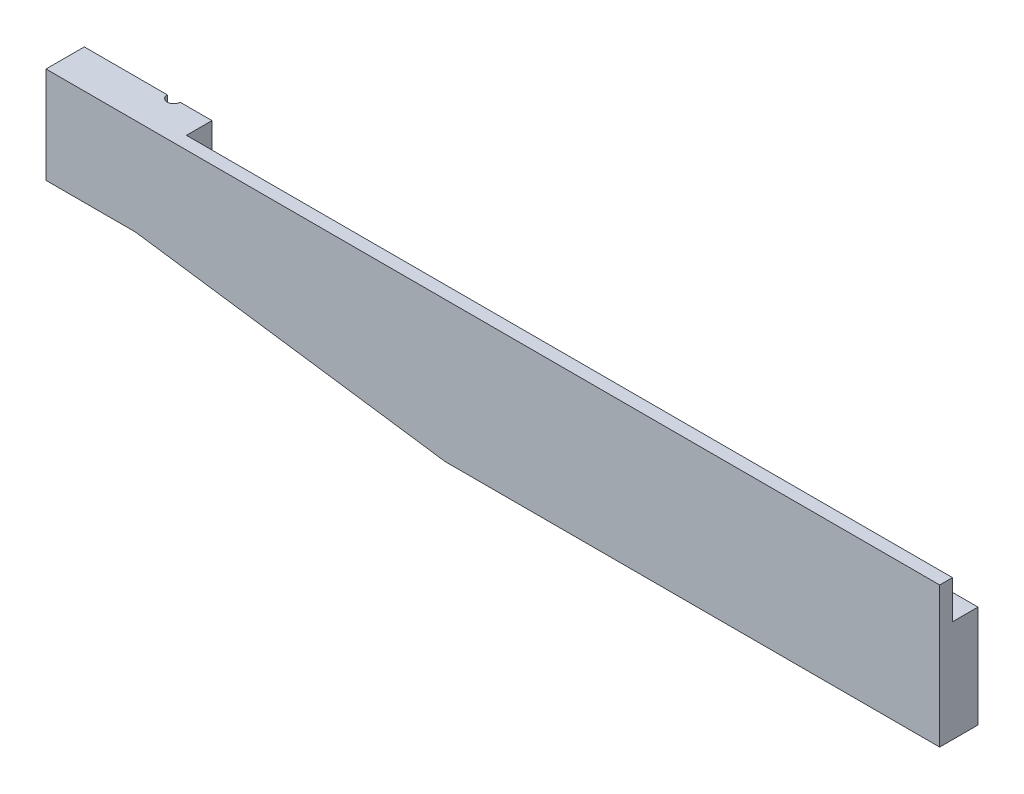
ISO-10303-21;
HEADER;
FILE_DESCRIPTION(('STEP AP214'),'2;1');
FILE_NAME('part.step','',(''),(''),'','','');
FILE_SCHEMA(('AUTOMOTIVE_DESIGN { 1 0 10303 214 1 1 1 1 }'));
ENDSEC;
DATA;
#1=APPLICATION_CONTEXT('core data for automotive mechanical design processes');
#2=APPLICATION_PROTOCOL_DEFINITION('international standard','automotive_design',2000,#1);
#3=PRODUCT_CONTEXT('',#1,'mechanical');
#4=PRODUCT('Part','Part','',(#3));
#5=PRODUCT_RELATED_PRODUCT_CATEGORY('part','',(#4));
#6=PRODUCT_DEFINITION_FORMATION('','',#4);
#7=PRODUCT_DEFINITION_CONTEXT('part definition',#1,'design');
#8=PRODUCT_DEFINITION('design','',#6,#7);
#9=PRODUCT_DEFINITION_SHAPE('','',#8);
#10=(LENGTH_UNIT() NAMED_UNIT(*) SI_UNIT(.MILLI.,.METRE.));
#11=(NAMED_UNIT(*) PLANE_ANGLE_UNIT() SI_UNIT($,.RADIAN.));
#12=(NAMED_UNIT(*) SI_UNIT($,.STERADIAN.) SOLID_ANGLE_UNIT());
#13=UNCERTAINTY_MEASURE_WITH_UNIT(LENGTH_MEASURE(1.E-05),#10,'distance_accuracy_value','');
#14=(GEOMETRIC_REPRESENTATION_CONTEXT(3) GLOBAL_UNCERTAINTY_ASSIGNED_CONTEXT((#13)) GLOBAL_UNIT_ASSIGNED_CONTEXT((#10,
#11,#12)) REPRESENTATION_CONTEXT('',''));
#15=CARTESIAN_POINT('',(0.,0.,0.));
#16=DIRECTION('',(0.,0.,1.));
#17=DIRECTION('',(1.,0.,0.));
#18=AXIS2_PLACEMENT_3D('',#15,#16,#17);
#19=CARTESIAN_POINT('',(-629.274019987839,69.85,-19.05));
#20=DIRECTION('',(0.,0.,1.));
#21=DIRECTION('',(1.,0.,0.));
#22=AXIS2_PLACEMENT_3D('',#19,#20,#21);
#23=PLANE('',#22);
#24=DIRECTION('',(-0.990076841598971,0.14052703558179,0.));
#25=VECTOR('',#24,1.);
#26=CARTESIAN_POINT('',(-631.424826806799,54.696588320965,-19.05));
#27=LINE('',#26,#25);
#28=CARTESIAN_POINT('',(-246.0625,0.,-19.05));
#29=VERTEX_POINT('',#28);
#30=CARTESIAN_POINT('',(-396.875,21.4056451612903,-19.05));
#31=VERTEX_POINT('',#30);
#32=EDGE_CURVE('E133',#29,#31,#27,.T.);
#33=ORIENTED_EDGE('',*,*,#32,.T.);
#34=DIRECTION('',(0.,1.,0.));
#35=VECTOR('',#34,1.);
#36=CARTESIAN_POINT('',(-396.875,-0.00100000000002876,-19.05));
#37=LINE('',#36,#35);
#38=CARTESIAN_POINT('',(-396.875,69.85,-19.05));
#39=VERTEX_POINT('',#38);
#40=EDGE_CURVE('E120',#39,#31,#37,.F.);
#41=ORIENTED_EDGE('',*,*,#40,.F.);
#42=DIRECTION('',(-1.,0.,0.));
#43=VECTOR('',#42,1.);
#44=CARTESIAN_POINT('',(-629.274019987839,69.85,-19.05));
#45=LINE('',#44,#43);
#46=CARTESIAN_POINT('',(-381.,69.85,-19.05));
#47=VERTEX_POINT('',#46);
#48=EDGE_CURVE('E131',#47,#39,#45,.T.);
#49=ORIENTED_EDGE('',*,*,#48,.F.);
#50=DIRECTION('',(0.,1.,0.));
#51=VECTOR('',#50,1.);
#52=CARTESIAN_POINT('',(-381.,50.8,-19.05));
#53=LINE('',#52,#51);
#54=CARTESIAN_POINT('',(-381.,50.8,-19.05));
#55=VERTEX_POINT('',#54);
#56=EDGE_CURVE('E58',#55,#47,#53,.T.);
#57=ORIENTED_EDGE('',*,*,#56,.F.);
#58=DIRECTION('',(1.,0.,0.));
#59=VECTOR('',#58,1.);
#60=CARTESIAN_POINT('',(-381.,50.8,-19.05));
#61=LINE('',#60,#59);
#62=CARTESIAN_POINT('',(0.,50.8,-19.05));
#63=VERTEX_POINT('',#62);
#64=EDGE_CURVE('E168',#55,#63,#61,.T.);
#65=ORIENTED_EDGE('',*,*,#64,.T.);
#66=DIRECTION('',(0.,-1.,0.));
#67=VECTOR('',#66,1.);
#68=CARTESIAN_POINT('',(0.,69.85,-19.05));
#69=LINE('',#68,#67);
#70=CARTESIAN_POINT('',(0.,0.,-19.05));
#71=VERTEX_POINT('',#70);
#72=EDGE_CURVE('E138',#63,#71,#69,.T.);
#73=ORIENTED_EDGE('',*,*,#72,.T.);
#74=DIRECTION('',(-1.,0.,0.));
#75=VECTOR('',#74,1.);
#76=CARTESIAN_POINT('',(-629.274019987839,0.,-19.05));
#77=LINE('',#76,#75);
#78=EDGE_CURVE('E154',#71,#29,#77,.T.);
#79=ORIENTED_EDGE('',*,*,#78,.T.);
#80=EDGE_LOOP('',(#33,#41,#49,#57,#65,#73,#79));
#81=FACE_BOUND('',#80,.T.);
#82=ADVANCED_FACE('F35',(#81),#23,.F.);
#83=CARTESIAN_POINT('',(-629.274019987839,69.85,0.));
#84=DIRECTION('',(0.,0.,1.));
#85=DIRECTION('',(1.,0.,0.));
#86=AXIS2_PLACEMENT_3D('',#83,#84,#85);
#87=PLANE('',#86);
#88=DIRECTION('',(-1.,0.,0.));
#89=VECTOR('',#88,1.);
#90=CARTESIAN_POINT('',(-629.274019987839,69.85,0.));
#91=LINE('',#90,#89);
#92=CARTESIAN_POINT('',(0.,69.85,0.));
#93=VERTEX_POINT('',#92);
#94=CARTESIAN_POINT('',(-444.5,69.85,0.));
#95=VERTEX_POINT('',#94);
#96=EDGE_CURVE('E155',#93,#95,#91,.T.);
#97=ORIENTED_EDGE('',*,*,#96,.T.);
#98=DIRECTION('',(0.,1.,0.));
#99=VECTOR('',#98,1.);
#100=CARTESIAN_POINT('',(-444.5,21.8562903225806,0.));
#101=LINE('',#100,#99);
#102=CARTESIAN_POINT('',(-444.5,21.8562903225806,0.));
#103=VERTEX_POINT('',#102);
#104=EDGE_CURVE('E216',#103,#95,#101,.T.);
#105=ORIENTED_EDGE('',*,*,#104,.F.);
#106=DIRECTION('',(1.,0.,0.));
#107=VECTOR('',#106,1.);
#108=CARTESIAN_POINT('',(-444.5,21.8562903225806,0.));
#109=LINE('',#108,#107);
#110=CARTESIAN_POINT('',(-400.05,21.8562903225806,0.));
#111=VERTEX_POINT('',#110);
#112=EDGE_CURVE('E177',#103,#111,#109,.T.);
#113=ORIENTED_EDGE('',*,*,#112,.T.);
#114=DIRECTION('',(-0.990076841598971,0.14052703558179,0.));
#115=VECTOR('',#114,1.);
#116=CARTESIAN_POINT('',(-631.424826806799,54.696588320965,0.));
#117=LINE('',#116,#115);
#118=CARTESIAN_POINT('',(-246.0625,0.,0.));
#119=VERTEX_POINT('',#118);
#120=EDGE_CURVE('E151',#119,#111,#117,.T.);
#121=ORIENTED_EDGE('',*,*,#120,.F.);
#122=DIRECTION('',(-1.,0.,0.));
#123=VECTOR('',#122,1.);
#124=CARTESIAN_POINT('',(-629.274019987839,0.,0.));
#125=LINE('',#124,#123);
#126=CARTESIAN_POINT('',(0.,0.,0.));
#127=VERTEX_POINT('',#126);
#128=EDGE_CURVE('E147',#127,#119,#125,.T.);
#129=ORIENTED_EDGE('',*,*,#128,.F.);
#130=DIRECTION('',(0.,-1.,0.));
#131=VECTOR('',#130,1.);
#132=CARTESIAN_POINT('',(0.,69.85,0.));
#133=LINE('',#132,#131);
#134=EDGE_CURVE('E141',#93,#127,#133,.T.);
#135=ORIENTED_EDGE('',*,*,#134,.F.);
#136=EDGE_LOOP('',(#97,#105,#113,#121,#129,#135));
#137=FACE_BOUND('',#136,.T.);
#138=ADVANCED_FACE('F37',(#137),#87,.T.);
#139=CARTESIAN_POINT('',(-403.225,69.85,-19.05));
#140=VERTEX_POINT('',#139);
#141=CARTESIAN_POINT('',(-444.5,69.85,-19.05));
#142=VERTEX_POINT('',#141);
#143=EDGE_CURVE('E139',#140,#142,#45,.T.);
#144=ORIENTED_EDGE('',*,*,#143,.F.);
#145=DIRECTION('',(0.,1.,0.));
#146=VECTOR('',#145,1.);
#147=CARTESIAN_POINT('',(-403.225,-0.00100000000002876,-19.05));
#148=LINE('',#147,#146);
#149=CARTESIAN_POINT('',(-403.225,21.8562903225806,-19.05));
#150=VERTEX_POINT('',#149);
#151=EDGE_CURVE('E122',#150,#140,#148,.T.);
#152=ORIENTED_EDGE('',*,*,#151,.F.);
#153=DIRECTION('',(1.,0.,0.));
#154=VECTOR('',#153,1.);
#155=CARTESIAN_POINT('',(-444.5,21.8562903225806,-19.05));
#156=LINE('',#155,#154);
#157=CARTESIAN_POINT('',(-444.5,21.8562903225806,-19.05));
#158=VERTEX_POINT('',#157);
#159=EDGE_CURVE('E191',#158,#150,#156,.T.);
#160=ORIENTED_EDGE('',*,*,#159,.F.);
#161=DIRECTION('',(0.,-1.,0.));
#162=VECTOR('',#161,1.);
#163=CARTESIAN_POINT('',(-444.5,21.8562903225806,-19.05));
#164=LINE('',#163,#162);
#165=EDGE_CURVE('E211',#142,#158,#164,.T.);
#166=ORIENTED_EDGE('',*,*,#165,.F.);
#167=EDGE_LOOP('',(#144,#152,#160,#166));
#168=FACE_BOUND('',#167,.T.);
#169=ADVANCED_FACE('F224',(#168),#23,.F.);
#170=CARTESIAN_POINT('',(-629.274019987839,69.85,-9.52499999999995));
#171=DIRECTION('',(0.,1.,0.));
#172=DIRECTION('',(0.,0.,1.));
#173=AXIS2_PLACEMENT_3D('',#170,#171,#172);
#174=PLANE('',#173);
#175=CARTESIAN_POINT('',(-400.05,69.85,-19.05));
#176=DIRECTION('',(0.,1.,0.));
#177=DIRECTION('',(0.,0.,1.));
#178=AXIS2_PLACEMENT_3D('',#175,#176,#177);
#179=CIRCLE('',#178,3.17499999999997);
#180=EDGE_CURVE('E117',#140,#39,#179,.T.);
#181=ORIENTED_EDGE('',*,*,#180,.F.);
#182=ORIENTED_EDGE('',*,*,#143,.T.);
#183=DIRECTION('',(0.,0.,-1.));
#184=VECTOR('',#183,1.);
#185=CARTESIAN_POINT('',(-444.5,69.85,0.));
#186=LINE('',#185,#184);
#187=EDGE_CURVE('E213',#95,#142,#186,.T.);
#188=ORIENTED_EDGE('',*,*,#187,.F.);
#189=ORIENTED_EDGE('',*,*,#96,.F.);
#190=DIRECTION('',(0.,0.,-1.));
#191=VECTOR('',#190,1.);
#192=CARTESIAN_POINT('',(0.,69.85,-9.52499999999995));
#193=LINE('',#192,#191);
#194=CARTESIAN_POINT('',(0.,69.85,-6.35));
#195=VERTEX_POINT('',#194);
#196=EDGE_CURVE('E143',#93,#195,#193,.T.);
#197=ORIENTED_EDGE('',*,*,#196,.T.);
#198=DIRECTION('',(1.,0.,0.));
#199=VECTOR('',#198,1.);
#200=CARTESIAN_POINT('',(-381.,69.85,-6.35));
#201=LINE('',#200,#199);
#202=CARTESIAN_POINT('',(-381.,69.85,-6.35));
#203=VERTEX_POINT('',#202);
#204=EDGE_CURVE('E185',#203,#195,#201,.T.);
#205=ORIENTED_EDGE('',*,*,#204,.F.);
#206=DIRECTION('',(0.,0.,1.));
#207=VECTOR('',#206,1.);
#208=CARTESIAN_POINT('',(-381.,69.85,-19.05));
#209=LINE('',#208,#207);
#210=EDGE_CURVE('E137',#47,#203,#209,.T.);
#211=ORIENTED_EDGE('',*,*,#210,.F.);
#212=ORIENTED_EDGE('',*,*,#48,.T.);
#213=EDGE_LOOP('',(#181,#182,#188,#189,#197,#205,#211,#212));
#214=FACE_BOUND('',#213,.T.);
#215=ADVANCED_FACE('F135',(#214),#174,.T.);
#216=CARTESIAN_POINT('',(-492.125,34.925,621.777870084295));
#217=DIRECTION('',(0.14052703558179,0.990076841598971,0.));
#218=DIRECTION('',(-0.990076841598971,0.14052703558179,0.));
#219=AXIS2_PLACEMENT_3D('',#216,#217,#218);
#220=PLANE('',#219);
#221=DIRECTION('',(0.,0.,1.));
#222=VECTOR('',#221,1.);
#223=CARTESIAN_POINT('',(-400.05,21.8562903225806,621.777870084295));
#224=LINE('',#223,#222);
#225=CARTESIAN_POINT('',(-400.05,21.8562903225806,-15.875));
#226=VERTEX_POINT('',#225);
#227=EDGE_CURVE('E11',#226,#111,#224,.T.);
#228=ORIENTED_EDGE('',*,*,#227,.F.);
#229=CARTESIAN_POINT('',(-400.05,21.8562903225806,-19.05));
#230=DIRECTION('',(0.14052703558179,0.990076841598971,0.));
#231=DIRECTION('',(-0.990076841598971,0.14052703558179,0.));
#232=AXIS2_PLACEMENT_3D('',#229,#230,#231);
#233=ELLIPSE('',#232,3.20682180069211,3.17499999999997);
#234=EDGE_CURVE('E50',#31,#226,#233,.F.);
#235=ORIENTED_EDGE('',*,*,#234,.F.);
#236=ORIENTED_EDGE('',*,*,#32,.F.);
#237=DIRECTION('',(0.,0.,-1.));
#238=VECTOR('',#237,1.);
#239=CARTESIAN_POINT('',(-246.0625,0.,-9.52499999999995));
#240=LINE('',#239,#238);
#241=EDGE_CURVE('E43',#119,#29,#240,.T.);
#242=ORIENTED_EDGE('',*,*,#241,.F.);
#243=ORIENTED_EDGE('',*,*,#120,.T.);
#244=EDGE_LOOP('',(#228,#235,#236,#242,#243));
#245=FACE_BOUND('',#244,.T.);
#246=ADVANCED_FACE('F249',(#245),#220,.F.);
#247=CARTESIAN_POINT('',(0.,69.85,-9.52499999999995));
#248=DIRECTION('',(-1.,0.,0.));
#249=DIRECTION('',(0.,0.,1.));
#250=AXIS2_PLACEMENT_3D('',#247,#248,#249);
#251=PLANE('',#250);
#252=ORIENTED_EDGE('',*,*,#72,.F.);
#253=DIRECTION('',(0.,0.,-1.));
#254=VECTOR('',#253,1.);
#255=CARTESIAN_POINT('',(0.,50.8,-19.05));
#256=LINE('',#255,#254);
#257=CARTESIAN_POINT('',(0.,50.8,-6.35));
#258=VERTEX_POINT('',#257);
#259=EDGE_CURVE('E189',#258,#63,#256,.T.);
#260=ORIENTED_EDGE('',*,*,#259,.F.);
#261=DIRECTION('',(0.,-1.,0.));
#262=VECTOR('',#261,1.);
#263=CARTESIAN_POINT('',(0.,69.85,-6.35));
#264=LINE('',#263,#262);
#265=EDGE_CURVE('E188',#195,#258,#264,.T.);
#266=ORIENTED_EDGE('',*,*,#265,.F.);
#267=ORIENTED_EDGE('',*,*,#196,.F.);
#268=ORIENTED_EDGE('',*,*,#134,.T.);
#269=DIRECTION('',(0.,0.,-1.));
#270=VECTOR('',#269,1.);
#271=CARTESIAN_POINT('',(0.,0.,-9.52499999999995));
#272=LINE('',#271,#270);
#273=EDGE_CURVE('E150',#127,#71,#272,.T.);
#274=ORIENTED_EDGE('',*,*,#273,.T.);
#275=EDGE_LOOP('',(#252,#260,#266,#267,#268,#274));
#276=FACE_BOUND('',#275,.T.);
#277=ADVANCED_FACE('F171',(#276),#251,.F.);
#278=CARTESIAN_POINT('',(-629.274019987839,0.,-9.52499999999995));
#279=DIRECTION('',(0.,1.,0.));
#280=DIRECTION('',(0.,0.,1.));
#281=AXIS2_PLACEMENT_3D('',#278,#279,#280);
#282=PLANE('',#281);
#283=ORIENTED_EDGE('',*,*,#128,.T.);
#284=ORIENTED_EDGE('',*,*,#241,.T.);
#285=ORIENTED_EDGE('',*,*,#78,.F.);
#286=ORIENTED_EDGE('',*,*,#273,.F.);
#287=EDGE_LOOP('',(#283,#284,#285,#286));
#288=FACE_BOUND('',#287,.T.);
#289=ADVANCED_FACE('F160',(#288),#282,.F.);
#290=CARTESIAN_POINT('',(-381.,50.8,-19.05));
#291=DIRECTION('',(0.,-1.,0.));
#292=DIRECTION('',(0.,0.,-1.));
#293=AXIS2_PLACEMENT_3D('',#290,#291,#292);
#294=PLANE('',#293);
#295=ORIENTED_EDGE('',*,*,#259,.T.);
#296=ORIENTED_EDGE('',*,*,#64,.F.);
#297=DIRECTION('',(0.,0.,-1.));
#298=VECTOR('',#297,1.);
#299=CARTESIAN_POINT('',(-381.,50.8,-19.05));
#300=LINE('',#299,#298);
#301=CARTESIAN_POINT('',(-381.,50.8,-6.35));
#302=VERTEX_POINT('',#301);
#303=EDGE_CURVE('E201',#302,#55,#300,.T.);
#304=ORIENTED_EDGE('',*,*,#303,.F.);
#305=DIRECTION('',(1.,0.,0.));
#306=VECTOR('',#305,1.);
#307=CARTESIAN_POINT('',(-381.,50.8,-6.35));
#308=LINE('',#307,#306);
#309=EDGE_CURVE('E200',#302,#258,#308,.T.);
#310=ORIENTED_EDGE('',*,*,#309,.T.);
#311=EDGE_LOOP('',(#295,#296,#304,#310));
#312=FACE_BOUND('',#311,.T.);
#313=ADVANCED_FACE('F257',(#312),#294,.F.);
#314=CARTESIAN_POINT('',(-381.,69.85,-6.35));
#315=DIRECTION('',(0.,0.,1.));
#316=DIRECTION('',(0.,-1.,0.));
#317=AXIS2_PLACEMENT_3D('',#314,#315,#316);
#318=PLANE('',#317);
#319=ORIENTED_EDGE('',*,*,#265,.T.);
#320=ORIENTED_EDGE('',*,*,#309,.F.);
#321=DIRECTION('',(0.,-1.,0.));
#322=VECTOR('',#321,1.);
#323=CARTESIAN_POINT('',(-381.,69.85,-6.35));
#324=LINE('',#323,#322);
#325=EDGE_CURVE('E202',#203,#302,#324,.T.);
#326=ORIENTED_EDGE('',*,*,#325,.F.);
#327=ORIENTED_EDGE('',*,*,#204,.T.);
#328=EDGE_LOOP('',(#319,#320,#326,#327));
#329=FACE_BOUND('',#328,.T.);
#330=ADVANCED_FACE('F262',(#329),#318,.F.);
#331=CARTESIAN_POINT('',(-381.,69.85,-6.35));
#332=DIRECTION('',(1.,0.,0.));
#333=DIRECTION('',(0.,0.,-1.));
#334=AXIS2_PLACEMENT_3D('',#331,#332,#333);
#335=PLANE('',#334);
#336=ORIENTED_EDGE('',*,*,#210,.T.);
#337=ORIENTED_EDGE('',*,*,#325,.T.);
#338=ORIENTED_EDGE('',*,*,#303,.T.);
#339=ORIENTED_EDGE('',*,*,#56,.T.);
#340=EDGE_LOOP('',(#336,#337,#338,#339));
#341=FACE_BOUND('',#340,.T.);
#342=ADVANCED_FACE('F237',(#341),#335,.T.);
#343=CARTESIAN_POINT('',(-444.5,21.8562903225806,0.));
#344=DIRECTION('',(0.,1.,0.));
#345=DIRECTION('',(0.,0.,1.));
#346=AXIS2_PLACEMENT_3D('',#343,#344,#345);
#347=PLANE('',#346);
#348=ORIENTED_EDGE('',*,*,#159,.T.);
#349=CARTESIAN_POINT('',(-400.05,21.8562903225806,-19.05));
#350=DIRECTION('',(0.,1.,0.));
#351=DIRECTION('',(0.,0.,1.));
#352=AXIS2_PLACEMENT_3D('',#349,#350,#351);
#353=CIRCLE('',#352,3.17499999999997);
#354=EDGE_CURVE('E126',#226,#150,#353,.F.);
#355=ORIENTED_EDGE('',*,*,#354,.F.);
#356=ORIENTED_EDGE('',*,*,#227,.T.);
#357=ORIENTED_EDGE('',*,*,#112,.F.);
#358=DIRECTION('',(0.,0.,1.));
#359=VECTOR('',#358,1.);
#360=CARTESIAN_POINT('',(-444.5,21.8562903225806,0.));
#361=LINE('',#360,#359);
#362=EDGE_CURVE('E209',#158,#103,#361,.T.);
#363=ORIENTED_EDGE('',*,*,#362,.F.);
#364=EDGE_LOOP('',(#348,#355,#356,#357,#363));
#365=FACE_BOUND('',#364,.T.);
#366=ADVANCED_FACE('F227',(#365),#347,.F.);
#367=CARTESIAN_POINT('',(-444.5,69.85,0.));
#368=DIRECTION('',(-1.,0.,0.));
#369=DIRECTION('',(0.,0.,1.));
#370=AXIS2_PLACEMENT_3D('',#367,#368,#369);
#371=PLANE('',#370);
#372=ORIENTED_EDGE('',*,*,#104,.T.);
#373=ORIENTED_EDGE('',*,*,#187,.T.);
#374=ORIENTED_EDGE('',*,*,#165,.T.);
#375=ORIENTED_EDGE('',*,*,#362,.T.);
#376=EDGE_LOOP('',(#372,#373,#374,#375));
#377=FACE_BOUND('',#376,.T.);
#378=ADVANCED_FACE('F229',(#377),#371,.T.);
#379=CARTESIAN_POINT('',(-400.05,-0.00100000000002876,-19.05));
#380=DIRECTION('',(0.,1.,0.));
#381=DIRECTION('',(0.,0.,1.));
#382=AXIS2_PLACEMENT_3D('',#379,#380,#381);
#383=CYLINDRICAL_SURFACE('',#382,3.17499999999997);
#384=ORIENTED_EDGE('',*,*,#40,.T.);
#385=ORIENTED_EDGE('',*,*,#234,.T.);
#386=ORIENTED_EDGE('',*,*,#354,.T.);
#387=ORIENTED_EDGE('',*,*,#151,.T.);
#388=ORIENTED_EDGE('',*,*,#180,.T.);
#389=EDGE_LOOP('',(#384,#385,#386,#387,#388));
#390=FACE_BOUND('',#389,.T.);
#391=ADVANCED_FACE('F119',(#390),#383,.F.);
#392=CLOSED_SHELL('',(#82,#138,#169,#215,#246,#277,#289,#313,#330,#342,#366,#378,#391));
#393=MANIFOLD_SOLID_BREP('B2',#392);
#394=ADVANCED_BREP_SHAPE_REPRESENTATION('',(#18,#393),#14);
#395=SHAPE_DEFINITION_REPRESENTATION(#9,#394);
ENDSEC;
END-ISO-10303-21;
